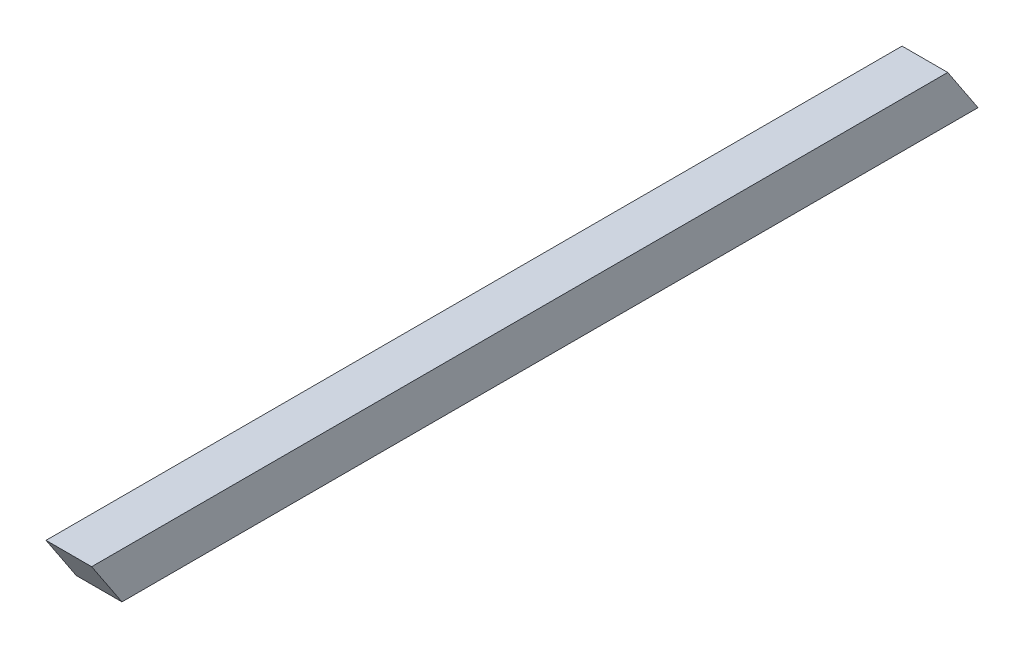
from build123d import *

# Parameters (mm, degrees)
ESQUISSE1_W             = 4
ESQUISSE1_H             = 4
EXTRUSION1_DEPTH        = 37.5
ENL_V_MAT_EXTRU_1_DEPTH = 300
EXTRUSION2_DEPTH        = 4


with BuildPart() as part:
    # Esquisse1 → Extrusion1 (new, symmetric)
    with BuildSketch(Plane.XY):
        Rectangle(ESQUISSE1_W, ESQUISSE1_H)
    extrude(amount=EXTRUSION1_DEPTH, both=True)

    # Esquisse2 → Enl_v. mat.-Extru.1 (cut)
    with BuildSketch(Plane.ZY.offset(2)):
        Polygon((-37.5, -2), (-34.846700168, 2), (-37.5, 2), align=None)
    extrude(amount=-ENL_V_MAT_EXTRU_1_DEPTH, mode=Mode.SUBTRACT)

    # Esquisse3 → Extrusion2 (add)
    with BuildSketch(Plane.ZY.offset(2)):
        Polygon((37.5, 2), (37.5, -2), (40.153299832, 2), align=None)
    extrude(amount=-EXTRUSION2_DEPTH)


solid = part.part
